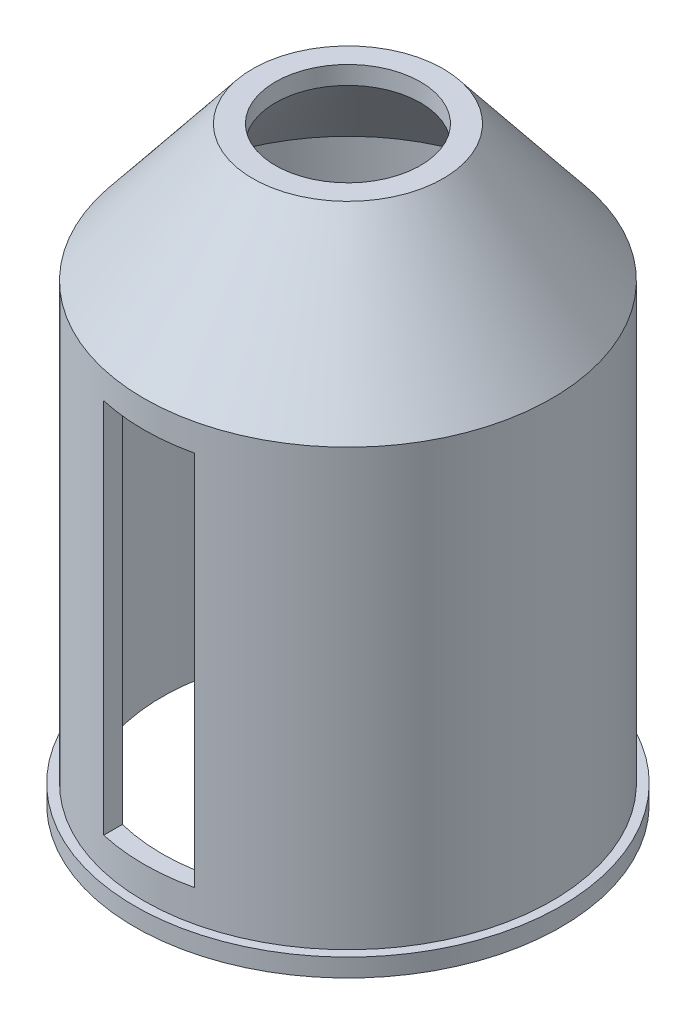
ISO-10303-21;
HEADER;
FILE_DESCRIPTION(('STEP AP214'),'2;1');
FILE_NAME('part.step','',(''),(''),'','','');
FILE_SCHEMA(('AUTOMOTIVE_DESIGN { 1 0 10303 214 1 1 1 1 }'));
ENDSEC;
DATA;
#1=APPLICATION_CONTEXT('core data for automotive mechanical design processes');
#2=APPLICATION_PROTOCOL_DEFINITION('international standard','automotive_design',2000,#1);
#3=PRODUCT_CONTEXT('',#1,'mechanical');
#4=PRODUCT('Part','Part','',(#3));
#5=PRODUCT_RELATED_PRODUCT_CATEGORY('part','',(#4));
#6=PRODUCT_DEFINITION_FORMATION('','',#4);
#7=PRODUCT_DEFINITION_CONTEXT('part definition',#1,'design');
#8=PRODUCT_DEFINITION('design','',#6,#7);
#9=PRODUCT_DEFINITION_SHAPE('','',#8);
#10=(LENGTH_UNIT() NAMED_UNIT(*) SI_UNIT(.MILLI.,.METRE.));
#11=(NAMED_UNIT(*) PLANE_ANGLE_UNIT() SI_UNIT($,.RADIAN.));
#12=(NAMED_UNIT(*) SI_UNIT($,.STERADIAN.) SOLID_ANGLE_UNIT());
#13=UNCERTAINTY_MEASURE_WITH_UNIT(LENGTH_MEASURE(1.E-05),#10,'distance_accuracy_value','');
#14=(GEOMETRIC_REPRESENTATION_CONTEXT(3) GLOBAL_UNCERTAINTY_ASSIGNED_CONTEXT((#13)) GLOBAL_UNIT_ASSIGNED_CONTEXT((#10,
#11,#12)) REPRESENTATION_CONTEXT('',''));
#15=CARTESIAN_POINT('',(0.,0.,0.));
#16=DIRECTION('',(0.,0.,1.));
#17=DIRECTION('',(1.,0.,0.));
#18=AXIS2_PLACEMENT_3D('',#15,#16,#17);
#19=CARTESIAN_POINT('',(0.,81.1275030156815,0.));
#20=DIRECTION('',(0.,-1.,0.));
#21=DIRECTION('',(0.,0.,-1.));
#22=AXIS2_PLACEMENT_3D('',#19,#20,#21);
#23=PLANE('',#22);
#24=CARTESIAN_POINT('',(0.,81.1275030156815,0.));
#25=DIRECTION('',(0.,-1.,0.));
#26=DIRECTION('',(0.,0.,-1.));
#27=AXIS2_PLACEMENT_3D('',#24,#25,#26);
#28=CIRCLE('',#27,0.8);
#29=CARTESIAN_POINT('',(0.,81.1275030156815,-0.8));
#30=VERTEX_POINT('',#29);
#31=EDGE_CURVE('E19',#30,#30,#28,.F.);
#32=ORIENTED_EDGE('',*,*,#31,.T.);
#33=EDGE_LOOP('',(#32));
#34=FACE_BOUND('',#33,.T.);
#35=CARTESIAN_POINT('',(0.,81.1275030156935,0.));
#36=DIRECTION('',(0.,-1.,0.));
#37=DIRECTION('',(0.,0.,-1.));
#38=AXIS2_PLACEMENT_3D('',#35,#36,#37);
#39=CIRCLE('',#38,0.953875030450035);
#40=CARTESIAN_POINT('',(0.,81.1275030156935,-0.953875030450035));
#41=VERTEX_POINT('',#40);
#42=EDGE_CURVE('E174',#41,#41,#39,.T.);
#43=ORIENTED_EDGE('',*,*,#42,.T.);
#44=EDGE_LOOP('',(#43));
#45=FACE_BOUND('',#44,.T.);
#46=ADVANCED_FACE('F16',(#34,#45),#23,.T.);
#47=CARTESIAN_POINT('',(0.,81.3275030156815,0.));
#48=DIRECTION('',(0.,-1.,0.));
#49=DIRECTION('',(0.,0.,-1.));
#50=AXIS2_PLACEMENT_3D('',#47,#48,#49);
#51=CYLINDRICAL_SURFACE('',#50,0.8);
#52=CARTESIAN_POINT('',(0.,81.3275030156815,0.));
#53=DIRECTION('',(0.,-1.,0.));
#54=DIRECTION('',(0.,0.,-1.));
#55=AXIS2_PLACEMENT_3D('',#52,#53,#54);
#56=CIRCLE('',#55,0.8);
#57=CARTESIAN_POINT('',(0.,81.3275030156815,-0.8));
#58=VERTEX_POINT('',#57);
#59=EDGE_CURVE('E148',#58,#58,#56,.T.);
#60=ORIENTED_EDGE('',*,*,#59,.F.);
#61=EDGE_LOOP('',(#60));
#62=FACE_BOUND('',#61,.T.);
#63=ORIENTED_EDGE('',*,*,#31,.F.);
#64=EDGE_LOOP('',(#63));
#65=FACE_BOUND('',#64,.T.);
#66=ADVANCED_FACE('F182',(#62,#65),#51,.F.);
#67=CARTESIAN_POINT('',(0.,79.7573468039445,0.));
#68=DIRECTION('',(0.,-1.,0.));
#69=DIRECTION('',(0.,0.,-1.));
#70=AXIS2_PLACEMENT_3D('',#67,#68,#69);
#71=CONICAL_SURFACE('',#70,2.04999999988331,0.674740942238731);
#72=ORIENTED_EDGE('',*,*,#42,.F.);
#73=EDGE_LOOP('',(#72));
#74=FACE_BOUND('',#73,.T.);
#75=CARTESIAN_POINT('',(0.,79.7573468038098,0.));
#76=DIRECTION('',(0.,-1.,0.));
#77=DIRECTION('',(0.,0.,-1.));
#78=AXIS2_PLACEMENT_3D('',#75,#76,#77);
#79=CIRCLE('',#78,2.05);
#80=CARTESIAN_POINT('',(0.,79.7573468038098,-2.05));
#81=VERTEX_POINT('',#80);
#82=EDGE_CURVE('E87',#81,#81,#79,.T.);
#83=ORIENTED_EDGE('',*,*,#82,.T.);
#84=EDGE_LOOP('',(#83));
#85=FACE_BOUND('',#84,.T.);
#86=ADVANCED_FACE('F184',(#74,#85),#71,.F.);
#87=CARTESIAN_POINT('',(0.,74.8275030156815,0.));
#88=DIRECTION('',(0.,1.,0.));
#89=DIRECTION('',(0.,0.,1.));
#90=AXIS2_PLACEMENT_3D('',#87,#88,#89);
#91=PLANE('',#90);
#92=CARTESIAN_POINT('',(0.,74.8275030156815,0.));
#93=DIRECTION('',(0.,-1.,0.));
#94=DIRECTION('',(0.,0.,-1.));
#95=AXIS2_PLACEMENT_3D('',#92,#93,#94);
#96=CIRCLE('',#95,2.05);
#97=CARTESIAN_POINT('',(0.,74.8275030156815,-2.05));
#98=VERTEX_POINT('',#97);
#99=EDGE_CURVE('E86',#98,#98,#96,.F.);
#100=ORIENTED_EDGE('',*,*,#99,.T.);
#101=EDGE_LOOP('',(#100));
#102=FACE_BOUND('',#101,.T.);
#103=CARTESIAN_POINT('',(0.,74.8275030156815,0.));
#104=DIRECTION('',(0.,-1.,0.));
#105=DIRECTION('',(0.,0.,-1.));
#106=AXIS2_PLACEMENT_3D('',#103,#104,#105);
#107=CIRCLE('',#106,2.35);
#108=CARTESIAN_POINT('',(0.,74.8275030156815,-2.35));
#109=VERTEX_POINT('',#108);
#110=EDGE_CURVE('E172',#109,#109,#107,.F.);
#111=ORIENTED_EDGE('',*,*,#110,.F.);
#112=EDGE_LOOP('',(#111));
#113=FACE_BOUND('',#112,.T.);
#114=ADVANCED_FACE('F191',(#102,#113),#91,.F.);
#115=CARTESIAN_POINT('',(0.,75.0275030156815,0.));
#116=DIRECTION('',(0.,-1.,0.));
#117=DIRECTION('',(0.,0.,-1.));
#118=AXIS2_PLACEMENT_3D('',#115,#116,#117);
#119=CYLINDRICAL_SURFACE('',#118,2.35);
#120=ORIENTED_EDGE('',*,*,#110,.T.);
#121=EDGE_LOOP('',(#120));
#122=FACE_BOUND('',#121,.T.);
#123=CARTESIAN_POINT('',(0.,75.0275030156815,0.));
#124=DIRECTION('',(0.,-1.,0.));
#125=DIRECTION('',(0.,0.,-1.));
#126=AXIS2_PLACEMENT_3D('',#123,#124,#125);
#127=CIRCLE('',#126,2.35);
#128=CARTESIAN_POINT('',(0.,75.0275030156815,-2.35));
#129=VERTEX_POINT('',#128);
#130=EDGE_CURVE('E165',#129,#129,#127,.F.);
#131=ORIENTED_EDGE('',*,*,#130,.F.);
#132=EDGE_LOOP('',(#131));
#133=FACE_BOUND('',#132,.T.);
#134=ADVANCED_FACE('F244',(#122,#133),#119,.T.);
#135=CARTESIAN_POINT('',(0.,81.3275030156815,0.));
#136=DIRECTION('',(0.,1.,0.));
#137=DIRECTION('',(0.,0.,1.));
#138=AXIS2_PLACEMENT_3D('',#135,#136,#137);
#139=PLANE('',#138);
#140=ORIENTED_EDGE('',*,*,#59,.T.);
#141=EDGE_LOOP('',(#140));
#142=FACE_BOUND('',#141,.T.);
#143=CARTESIAN_POINT('',(0.,81.327503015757,0.));
#144=DIRECTION('',(0.,-1.,0.));
#145=DIRECTION('',(0.,0.,-1.));
#146=AXIS2_PLACEMENT_3D('',#143,#144,#145);
#147=CIRCLE('',#146,1.05000000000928);
#148=CARTESIAN_POINT('',(0.,81.327503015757,-1.05000000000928));
#149=VERTEX_POINT('',#148);
#150=EDGE_CURVE('E97',#149,#149,#147,.T.);
#151=ORIENTED_EDGE('',*,*,#150,.F.);
#152=EDGE_LOOP('',(#151));
#153=FACE_BOUND('',#152,.T.);
#154=ADVANCED_FACE('F240',(#142,#153),#139,.T.);
#155=CARTESIAN_POINT('',(0.,81.3275030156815,0.));
#156=DIRECTION('',(0.,-1.,0.));
#157=DIRECTION('',(0.,0.,-1.));
#158=AXIS2_PLACEMENT_3D('',#155,#156,#157);
#159=CYLINDRICAL_SURFACE('',#158,2.05);
#160=DIRECTION('',(0.,-1.,0.));
#161=VECTOR('',#160,1.);
#162=CARTESIAN_POINT('',(0.499999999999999,79.5775030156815,1.9880895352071));
#163=LINE('',#162,#161);
#164=CARTESIAN_POINT('',(0.499999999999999,79.5275030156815,1.9880895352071));
#165=VERTEX_POINT('',#164);
#166=CARTESIAN_POINT('',(0.500000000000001,75.3775030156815,1.9880895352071));
#167=VERTEX_POINT('',#166);
#168=EDGE_CURVE('E126',#165,#167,#163,.T.);
#169=ORIENTED_EDGE('',*,*,#168,.F.);
#170=CARTESIAN_POINT('',(0.,79.5275030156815,0.));
#171=DIRECTION('',(0.,-1.,0.));
#172=DIRECTION('',(0.,0.,-1.));
#173=AXIS2_PLACEMENT_3D('',#170,#171,#172);
#174=CIRCLE('',#173,2.05);
#175=CARTESIAN_POINT('',(-0.500000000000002,79.5275030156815,1.9880895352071));
#176=VERTEX_POINT('',#175);
#177=EDGE_CURVE('E141',#176,#165,#174,.F.);
#178=ORIENTED_EDGE('',*,*,#177,.F.);
#179=DIRECTION('',(0.,1.,0.));
#180=VECTOR('',#179,1.);
#181=CARTESIAN_POINT('',(-0.500000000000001,75.3775030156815,1.9880895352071));
#182=LINE('',#181,#180);
#183=CARTESIAN_POINT('',(-0.500000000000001,75.3775030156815,1.9880895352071));
#184=VERTEX_POINT('',#183);
#185=EDGE_CURVE('E137',#184,#176,#182,.T.);
#186=ORIENTED_EDGE('',*,*,#185,.F.);
#187=CARTESIAN_POINT('',(0.,75.3775030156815,0.));
#188=DIRECTION('',(0.,-1.,0.));
#189=DIRECTION('',(0.,0.,-1.));
#190=AXIS2_PLACEMENT_3D('',#187,#188,#189);
#191=CIRCLE('',#190,2.05);
#192=EDGE_CURVE('E125',#167,#184,#191,.T.);
#193=ORIENTED_EDGE('',*,*,#192,.F.);
#194=EDGE_LOOP('',(#169,#178,#186,#193));
#195=FACE_BOUND('',#194,.T.);
#196=ORIENTED_EDGE('',*,*,#99,.F.);
#197=EDGE_LOOP('',(#196));
#198=FACE_BOUND('',#197,.T.);
#199=DIRECTION('',(0.,-1.,0.));
#200=VECTOR('',#199,1.);
#201=CARTESIAN_POINT('',(0.499999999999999,79.5775030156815,-1.9880895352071));
#202=LINE('',#201,#200);
#203=CARTESIAN_POINT('',(0.500000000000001,75.3775030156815,-1.9880895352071));
#204=VERTEX_POINT('',#203);
#205=CARTESIAN_POINT('',(0.499999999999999,79.5275030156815,-1.9880895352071));
#206=VERTEX_POINT('',#205);
#207=EDGE_CURVE('E90',#204,#206,#202,.F.);
#208=ORIENTED_EDGE('',*,*,#207,.F.);
#209=CARTESIAN_POINT('',(0.,75.3775030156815,0.));
#210=DIRECTION('',(0.,-1.,0.));
#211=DIRECTION('',(0.,0.,-1.));
#212=AXIS2_PLACEMENT_3D('',#209,#210,#211);
#213=CIRCLE('',#212,2.05);
#214=CARTESIAN_POINT('',(-0.500000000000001,75.3775030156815,-1.9880895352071));
#215=VERTEX_POINT('',#214);
#216=EDGE_CURVE('E80',#215,#204,#213,.T.);
#217=ORIENTED_EDGE('',*,*,#216,.F.);
#218=DIRECTION('',(0.,1.,0.));
#219=VECTOR('',#218,1.);
#220=CARTESIAN_POINT('',(-0.500000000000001,75.3775030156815,-1.9880895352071));
#221=LINE('',#220,#219);
#222=CARTESIAN_POINT('',(-0.500000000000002,79.5275030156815,-1.9880895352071));
#223=VERTEX_POINT('',#222);
#224=EDGE_CURVE('E107',#223,#215,#221,.F.);
#225=ORIENTED_EDGE('',*,*,#224,.F.);
#226=CARTESIAN_POINT('',(0.,79.5275030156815,0.));
#227=DIRECTION('',(0.,-1.,0.));
#228=DIRECTION('',(0.,0.,-1.));
#229=AXIS2_PLACEMENT_3D('',#226,#227,#228);
#230=CIRCLE('',#229,2.05);
#231=EDGE_CURVE('E93',#206,#223,#230,.F.);
#232=ORIENTED_EDGE('',*,*,#231,.F.);
#233=EDGE_LOOP('',(#208,#217,#225,#232));
#234=FACE_BOUND('',#233,.T.);
#235=ORIENTED_EDGE('',*,*,#82,.F.);
#236=EDGE_LOOP('',(#235));
#237=FACE_BOUND('',#236,.T.);
#238=ADVANCED_FACE('F91',(#195,#198,#234,#237),#159,.F.);
#239=CARTESIAN_POINT('',(0.,75.0275030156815,0.));
#240=DIRECTION('',(0.,1.,0.));
#241=DIRECTION('',(0.,0.,1.));
#242=AXIS2_PLACEMENT_3D('',#239,#240,#241);
#243=PLANE('',#242);
#244=CARTESIAN_POINT('',(0.,75.0275030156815,0.));
#245=DIRECTION('',(0.,-1.,0.));
#246=DIRECTION('',(0.,0.,-1.));
#247=AXIS2_PLACEMENT_3D('',#244,#245,#246);
#248=CIRCLE('',#247,2.25);
#249=CARTESIAN_POINT('',(0.,75.0275030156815,-2.25));
#250=VERTEX_POINT('',#249);
#251=EDGE_CURVE('E102',#250,#250,#248,.F.);
#252=ORIENTED_EDGE('',*,*,#251,.F.);
#253=EDGE_LOOP('',(#252));
#254=FACE_BOUND('',#253,.T.);
#255=ORIENTED_EDGE('',*,*,#130,.T.);
#256=EDGE_LOOP('',(#255));
#257=FACE_BOUND('',#256,.T.);
#258=ADVANCED_FACE('F233',(#254,#257),#243,.T.);
#259=CARTESIAN_POINT('',(-0.500000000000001,79.5275030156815,-3.1));
#260=DIRECTION('',(0.,-1.,0.));
#261=DIRECTION('',(0.,0.,-1.));
#262=AXIS2_PLACEMENT_3D('',#259,#260,#261);
#263=PLANE('',#262);
#264=ORIENTED_EDGE('',*,*,#177,.T.);
#265=DIRECTION('',(0.,0.,1.));
#266=VECTOR('',#265,1.);
#267=CARTESIAN_POINT('',(0.499999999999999,79.5275030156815,-3.1));
#268=LINE('',#267,#266);
#269=CARTESIAN_POINT('',(0.499999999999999,79.5275030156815,2.19374109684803));
#270=VERTEX_POINT('',#269);
#271=EDGE_CURVE('E138',#270,#165,#268,.F.);
#272=ORIENTED_EDGE('',*,*,#271,.F.);
#273=CARTESIAN_POINT('',(0.,79.5275030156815,0.));
#274=DIRECTION('',(0.,-1.,0.));
#275=DIRECTION('',(0.,0.,-1.));
#276=AXIS2_PLACEMENT_3D('',#273,#274,#275);
#277=CIRCLE('',#276,2.25);
#278=CARTESIAN_POINT('',(-0.500000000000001,79.5275030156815,2.19374109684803));
#279=VERTEX_POINT('',#278);
#280=EDGE_CURVE('E105',#279,#270,#277,.F.);
#281=ORIENTED_EDGE('',*,*,#280,.F.);
#282=DIRECTION('',(0.,0.,1.));
#283=VECTOR('',#282,1.);
#284=CARTESIAN_POINT('',(-0.500000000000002,79.5275030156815,-3.1));
#285=LINE('',#284,#283);
#286=EDGE_CURVE('E142',#176,#279,#285,.T.);
#287=ORIENTED_EDGE('',*,*,#286,.F.);
#288=EDGE_LOOP('',(#264,#272,#281,#287));
#289=FACE_BOUND('',#288,.T.);
#290=ADVANCED_FACE('F229',(#289),#263,.T.);
#291=CARTESIAN_POINT('',(0.499999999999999,79.5775030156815,-3.1));
#292=DIRECTION('',(-1.,0.,0.));
#293=DIRECTION('',(0.,-1.,0.));
#294=AXIS2_PLACEMENT_3D('',#291,#292,#293);
#295=PLANE('',#294);
#296=ORIENTED_EDGE('',*,*,#168,.T.);
#297=DIRECTION('',(0.,0.,1.));
#298=VECTOR('',#297,1.);
#299=CARTESIAN_POINT('',(0.500000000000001,75.3775030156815,-3.1));
#300=LINE('',#299,#298);
#301=CARTESIAN_POINT('',(0.5,75.3775030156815,2.19374109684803));
#302=VERTEX_POINT('',#301);
#303=EDGE_CURVE('E122',#302,#167,#300,.F.);
#304=ORIENTED_EDGE('',*,*,#303,.F.);
#305=DIRECTION('',(0.,-1.,0.));
#306=VECTOR('',#305,1.);
#307=CARTESIAN_POINT('',(0.499999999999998,81.3275030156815,2.19374109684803));
#308=LINE('',#307,#306);
#309=EDGE_CURVE('E127',#270,#302,#308,.T.);
#310=ORIENTED_EDGE('',*,*,#309,.F.);
#311=ORIENTED_EDGE('',*,*,#271,.T.);
#312=EDGE_LOOP('',(#296,#304,#310,#311));
#313=FACE_BOUND('',#312,.T.);
#314=ADVANCED_FACE('F225',(#313),#295,.T.);
#315=CARTESIAN_POINT('',(0.500000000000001,75.3775030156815,-3.1));
#316=DIRECTION('',(0.,1.,0.));
#317=DIRECTION('',(0.,0.,1.));
#318=AXIS2_PLACEMENT_3D('',#315,#316,#317);
#319=PLANE('',#318);
#320=ORIENTED_EDGE('',*,*,#192,.T.);
#321=DIRECTION('',(0.,0.,1.));
#322=VECTOR('',#321,1.);
#323=CARTESIAN_POINT('',(-0.500000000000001,75.3775030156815,-3.1));
#324=LINE('',#323,#322);
#325=CARTESIAN_POINT('',(-0.500000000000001,75.3775030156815,2.19374109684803));
#326=VERTEX_POINT('',#325);
#327=EDGE_CURVE('E134',#326,#184,#324,.F.);
#328=ORIENTED_EDGE('',*,*,#327,.F.);
#329=CARTESIAN_POINT('',(0.,75.3775030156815,0.));
#330=DIRECTION('',(0.,-1.,0.));
#331=DIRECTION('',(0.,0.,-1.));
#332=AXIS2_PLACEMENT_3D('',#329,#330,#331);
#333=CIRCLE('',#332,2.25);
#334=EDGE_CURVE('E130',#302,#326,#333,.T.);
#335=ORIENTED_EDGE('',*,*,#334,.F.);
#336=ORIENTED_EDGE('',*,*,#303,.T.);
#337=EDGE_LOOP('',(#320,#328,#335,#336));
#338=FACE_BOUND('',#337,.T.);
#339=ADVANCED_FACE('F221',(#338),#319,.T.);
#340=CARTESIAN_POINT('',(-0.500000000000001,75.3775030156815,-3.1));
#341=DIRECTION('',(1.,0.,0.));
#342=DIRECTION('',(0.,1.,0.));
#343=AXIS2_PLACEMENT_3D('',#340,#341,#342);
#344=PLANE('',#343);
#345=ORIENTED_EDGE('',*,*,#185,.T.);
#346=ORIENTED_EDGE('',*,*,#286,.T.);
#347=DIRECTION('',(0.,-1.,0.));
#348=VECTOR('',#347,1.);
#349=CARTESIAN_POINT('',(-0.500000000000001,81.3275030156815,2.19374109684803));
#350=LINE('',#349,#348);
#351=EDGE_CURVE('E131',#326,#279,#350,.F.);
#352=ORIENTED_EDGE('',*,*,#351,.F.);
#353=ORIENTED_EDGE('',*,*,#327,.T.);
#354=EDGE_LOOP('',(#345,#346,#352,#353));
#355=FACE_BOUND('',#354,.T.);
#356=ADVANCED_FACE('F217',(#355),#344,.T.);
#357=CARTESIAN_POINT('',(0.,79.8275030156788,0.));
#358=DIRECTION('',(0.,-1.,0.));
#359=DIRECTION('',(0.,0.,-1.));
#360=AXIS2_PLACEMENT_3D('',#357,#358,#359);
#361=CONICAL_SURFACE('',#360,2.25000000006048,0.674740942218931);
#362=ORIENTED_EDGE('',*,*,#150,.T.);
#363=EDGE_LOOP('',(#362));
#364=FACE_BOUND('',#363,.T.);
#365=CARTESIAN_POINT('',(0.,79.8275030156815,0.));
#366=DIRECTION('',(0.,-1.,0.));
#367=DIRECTION('',(0.,0.,-1.));
#368=AXIS2_PLACEMENT_3D('',#365,#366,#367);
#369=CIRCLE('',#368,2.25);
#370=CARTESIAN_POINT('',(0.,79.8275030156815,-2.25));
#371=VERTEX_POINT('',#370);
#372=EDGE_CURVE('E117',#371,#371,#369,.T.);
#373=ORIENTED_EDGE('',*,*,#372,.F.);
#374=EDGE_LOOP('',(#373));
#375=FACE_BOUND('',#374,.T.);
#376=ADVANCED_FACE('F214',(#364,#375),#361,.T.);
#377=CARTESIAN_POINT('',(0.499999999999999,79.5775030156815,-3.1));
#378=DIRECTION('',(-1.,0.,0.));
#379=DIRECTION('',(0.,-1.,0.));
#380=AXIS2_PLACEMENT_3D('',#377,#378,#379);
#381=PLANE('',#380);
#382=ORIENTED_EDGE('',*,*,#207,.T.);
#383=DIRECTION('',(0.,0.,-1.));
#384=VECTOR('',#383,1.);
#385=CARTESIAN_POINT('',(0.499999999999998,79.5275030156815,-3.1));
#386=LINE('',#385,#384);
#387=CARTESIAN_POINT('',(0.5,79.5275030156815,-2.19374109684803));
#388=VERTEX_POINT('',#387);
#389=EDGE_CURVE('E96',#388,#206,#386,.F.);
#390=ORIENTED_EDGE('',*,*,#389,.F.);
#391=DIRECTION('',(0.,-1.,0.));
#392=VECTOR('',#391,1.);
#393=CARTESIAN_POINT('',(0.500000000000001,81.3275030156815,-2.19374109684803));
#394=LINE('',#393,#392);
#395=CARTESIAN_POINT('',(0.500000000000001,75.3775030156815,-2.19374109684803));
#396=VERTEX_POINT('',#395);
#397=EDGE_CURVE('E101',#396,#388,#394,.F.);
#398=ORIENTED_EDGE('',*,*,#397,.F.);
#399=DIRECTION('',(0.,0.,1.));
#400=VECTOR('',#399,1.);
#401=CARTESIAN_POINT('',(0.500000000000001,75.3775030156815,-3.1));
#402=LINE('',#401,#400);
#403=EDGE_CURVE('E85',#204,#396,#402,.F.);
#404=ORIENTED_EDGE('',*,*,#403,.F.);
#405=EDGE_LOOP('',(#382,#390,#398,#404));
#406=FACE_BOUND('',#405,.T.);
#407=ADVANCED_FACE('F99',(#406),#381,.T.);
#408=CARTESIAN_POINT('',(-0.500000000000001,79.5275030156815,-3.1));
#409=DIRECTION('',(0.,-1.,0.));
#410=DIRECTION('',(0.,0.,-1.));
#411=AXIS2_PLACEMENT_3D('',#408,#409,#410);
#412=PLANE('',#411);
#413=ORIENTED_EDGE('',*,*,#231,.T.);
#414=DIRECTION('',(0.,0.,1.));
#415=VECTOR('',#414,1.);
#416=CARTESIAN_POINT('',(-0.500000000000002,79.5275030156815,-3.1));
#417=LINE('',#416,#415);
#418=CARTESIAN_POINT('',(-0.500000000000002,79.5275030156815,-2.19374109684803));
#419=VERTEX_POINT('',#418);
#420=EDGE_CURVE('E118',#419,#223,#417,.T.);
#421=ORIENTED_EDGE('',*,*,#420,.F.);
#422=CARTESIAN_POINT('',(0.,79.5275030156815,0.));
#423=DIRECTION('',(0.,-1.,0.));
#424=DIRECTION('',(0.,0.,-1.));
#425=AXIS2_PLACEMENT_3D('',#422,#423,#424);
#426=CIRCLE('',#425,2.25);
#427=EDGE_CURVE('E115',#388,#419,#426,.F.);
#428=ORIENTED_EDGE('',*,*,#427,.F.);
#429=ORIENTED_EDGE('',*,*,#389,.T.);
#430=EDGE_LOOP('',(#413,#421,#428,#429));
#431=FACE_BOUND('',#430,.T.);
#432=ADVANCED_FACE('F208',(#431),#412,.T.);
#433=CARTESIAN_POINT('',(-0.500000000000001,75.3775030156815,-3.1));
#434=DIRECTION('',(1.,0.,0.));
#435=DIRECTION('',(0.,1.,0.));
#436=AXIS2_PLACEMENT_3D('',#433,#434,#435);
#437=PLANE('',#436);
#438=ORIENTED_EDGE('',*,*,#224,.T.);
#439=DIRECTION('',(0.,0.,1.));
#440=VECTOR('',#439,1.);
#441=CARTESIAN_POINT('',(-0.500000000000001,75.3775030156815,-3.1));
#442=LINE('',#441,#440);
#443=CARTESIAN_POINT('',(-0.500000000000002,75.3775030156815,-2.19374109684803));
#444=VERTEX_POINT('',#443);
#445=EDGE_CURVE('E34',#444,#215,#442,.T.);
#446=ORIENTED_EDGE('',*,*,#445,.F.);
#447=DIRECTION('',(0.,-1.,0.));
#448=VECTOR('',#447,1.);
#449=CARTESIAN_POINT('',(-0.500000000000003,81.3275030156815,-2.19374109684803));
#450=LINE('',#449,#448);
#451=EDGE_CURVE('E25',#419,#444,#450,.T.);
#452=ORIENTED_EDGE('',*,*,#451,.F.);
#453=ORIENTED_EDGE('',*,*,#420,.T.);
#454=EDGE_LOOP('',(#438,#446,#452,#453));
#455=FACE_BOUND('',#454,.T.);
#456=ADVANCED_FACE('F202',(#455),#437,.T.);
#457=CARTESIAN_POINT('',(0.500000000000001,75.3775030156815,-3.1));
#458=DIRECTION('',(0.,1.,0.));
#459=DIRECTION('',(0.,0.,1.));
#460=AXIS2_PLACEMENT_3D('',#457,#458,#459);
#461=PLANE('',#460);
#462=ORIENTED_EDGE('',*,*,#216,.T.);
#463=ORIENTED_EDGE('',*,*,#403,.T.);
#464=CARTESIAN_POINT('',(0.,75.3775030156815,0.));
#465=DIRECTION('',(0.,-1.,0.));
#466=DIRECTION('',(0.,0.,-1.));
#467=AXIS2_PLACEMENT_3D('',#464,#465,#466);
#468=CIRCLE('',#467,2.25);
#469=EDGE_CURVE('E11',#444,#396,#468,.T.);
#470=ORIENTED_EDGE('',*,*,#469,.F.);
#471=ORIENTED_EDGE('',*,*,#445,.T.);
#472=EDGE_LOOP('',(#462,#463,#470,#471));
#473=FACE_BOUND('',#472,.T.);
#474=ADVANCED_FACE('F83',(#473),#461,.T.);
#475=CARTESIAN_POINT('',(0.,81.3275030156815,0.));
#476=DIRECTION('',(0.,-1.,0.));
#477=DIRECTION('',(0.,0.,-1.));
#478=AXIS2_PLACEMENT_3D('',#475,#476,#477);
#479=CYLINDRICAL_SURFACE('',#478,2.25);
#480=ORIENTED_EDGE('',*,*,#451,.T.);
#481=ORIENTED_EDGE('',*,*,#469,.T.);
#482=ORIENTED_EDGE('',*,*,#397,.T.);
#483=ORIENTED_EDGE('',*,*,#427,.T.);
#484=EDGE_LOOP('',(#480,#481,#482,#483));
#485=FACE_BOUND('',#484,.T.);
#486=ORIENTED_EDGE('',*,*,#372,.T.);
#487=EDGE_LOOP('',(#486));
#488=FACE_BOUND('',#487,.T.);
#489=ORIENTED_EDGE('',*,*,#334,.T.);
#490=ORIENTED_EDGE('',*,*,#351,.T.);
#491=ORIENTED_EDGE('',*,*,#280,.T.);
#492=ORIENTED_EDGE('',*,*,#309,.T.);
#493=EDGE_LOOP('',(#489,#490,#491,#492));
#494=FACE_BOUND('',#493,.T.);
#495=ORIENTED_EDGE('',*,*,#251,.T.);
#496=EDGE_LOOP('',(#495));
#497=FACE_BOUND('',#496,.T.);
#498=ADVANCED_FACE('F195',(#485,#488,#494,#497),#479,.T.);
#499=CLOSED_SHELL('',(#46,#66,#86,#114,#134,#154,#238,#258,#290,#314,#339,#356,#376,#407,#432,
#456,#474,#498));
#500=MANIFOLD_SOLID_BREP('B1',#499);
#501=ADVANCED_BREP_SHAPE_REPRESENTATION('',(#18,#500),#14);
#502=SHAPE_DEFINITION_REPRESENTATION(#9,#501);
ENDSEC;
END-ISO-10303-21;
